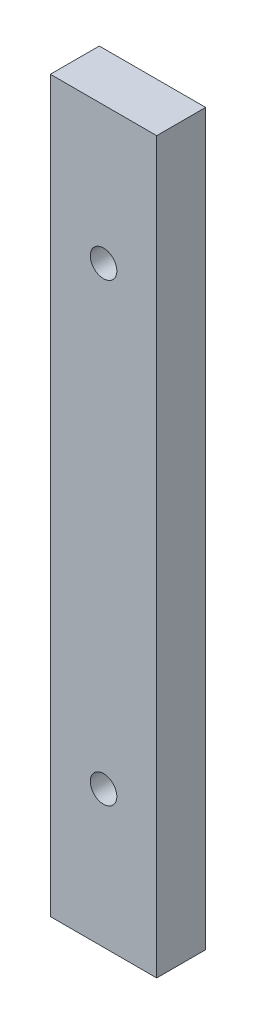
ISO-10303-21;
HEADER;
FILE_DESCRIPTION(('STEP AP214'),'2;1');
FILE_NAME('part.step','',(''),(''),'','','');
FILE_SCHEMA(('AUTOMOTIVE_DESIGN { 1 0 10303 214 1 1 1 1 }'));
ENDSEC;
DATA;
#1=APPLICATION_CONTEXT('core data for automotive mechanical design processes');
#2=APPLICATION_PROTOCOL_DEFINITION('international standard','automotive_design',2000,#1);
#3=PRODUCT_CONTEXT('',#1,'mechanical');
#4=PRODUCT('Part','Part','',(#3));
#5=PRODUCT_RELATED_PRODUCT_CATEGORY('part','',(#4));
#6=PRODUCT_DEFINITION_FORMATION('','',#4);
#7=PRODUCT_DEFINITION_CONTEXT('part definition',#1,'design');
#8=PRODUCT_DEFINITION('design','',#6,#7);
#9=PRODUCT_DEFINITION_SHAPE('','',#8);
#10=(LENGTH_UNIT() NAMED_UNIT(*) SI_UNIT(.MILLI.,.METRE.));
#11=(NAMED_UNIT(*) PLANE_ANGLE_UNIT() SI_UNIT($,.RADIAN.));
#12=(NAMED_UNIT(*) SI_UNIT($,.STERADIAN.) SOLID_ANGLE_UNIT());
#13=UNCERTAINTY_MEASURE_WITH_UNIT(LENGTH_MEASURE(1.E-05),#10,'distance_accuracy_value','');
#14=(GEOMETRIC_REPRESENTATION_CONTEXT(3) GLOBAL_UNCERTAINTY_ASSIGNED_CONTEXT((#13)) GLOBAL_UNIT_ASSIGNED_CONTEXT((#10,
#11,#12)) REPRESENTATION_CONTEXT('',''));
#15=CARTESIAN_POINT('',(0.,0.,0.));
#16=DIRECTION('',(0.,0.,1.));
#17=DIRECTION('',(1.,0.,0.));
#18=AXIS2_PLACEMENT_3D('',#15,#16,#17);
#19=CARTESIAN_POINT('',(0.,0.,4.6));
#20=DIRECTION('',(0.,0.,1.));
#21=DIRECTION('',(1.,0.,0.));
#22=AXIS2_PLACEMENT_3D('',#19,#20,#21);
#23=PLANE('',#22);
#24=CARTESIAN_POINT('',(-17.7963806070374,5.52254901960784,4.6));
#25=DIRECTION('',(0.,0.,1.));
#26=DIRECTION('',(1.,0.,0.));
#27=AXIS2_PLACEMENT_3D('',#24,#25,#26);
#28=CIRCLE('',#27,1.25);
#29=CARTESIAN_POINT('',(-16.5463806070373,5.52254901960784,4.6));
#30=VERTEX_POINT('',#29);
#31=EDGE_CURVE('E123',#30,#30,#28,.T.);
#32=ORIENTED_EDGE('',*,*,#31,.F.);
#33=EDGE_LOOP('',(#32));
#34=FACE_BOUND('',#33,.T.);
#35=CARTESIAN_POINT('',(-17.7963806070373,-37.2774509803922,4.6));
#36=DIRECTION('',(0.,0.,1.));
#37=DIRECTION('',(1.,0.,0.));
#38=AXIS2_PLACEMENT_3D('',#35,#36,#37);
#39=CIRCLE('',#38,1.25);
#40=CARTESIAN_POINT('',(-16.5463806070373,-37.2774509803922,4.6));
#41=VERTEX_POINT('',#40);
#42=EDGE_CURVE('E117',#41,#41,#39,.T.);
#43=ORIENTED_EDGE('',*,*,#42,.F.);
#44=EDGE_LOOP('',(#43));
#45=FACE_BOUND('',#44,.T.);
#46=DIRECTION('',(0.,-1.,0.));
#47=VECTOR('',#46,1.);
#48=CARTESIAN_POINT('',(-22.7963806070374,18.4225490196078,4.6));
#49=LINE('',#48,#47);
#50=CARTESIAN_POINT('',(-22.7963806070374,18.4225490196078,4.6));
#51=VERTEX_POINT('',#50);
#52=CARTESIAN_POINT('',(-22.7963806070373,-50.1774509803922,4.6));
#53=VERTEX_POINT('',#52);
#54=EDGE_CURVE('E89',#51,#53,#49,.T.);
#55=ORIENTED_EDGE('',*,*,#54,.T.);
#56=DIRECTION('',(1.,0.,0.));
#57=VECTOR('',#56,1.);
#58=CARTESIAN_POINT('',(-22.7963806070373,-50.1774509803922,4.6));
#59=LINE('',#58,#57);
#60=CARTESIAN_POINT('',(-12.7963806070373,-50.1774509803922,4.6));
#61=VERTEX_POINT('',#60);
#62=EDGE_CURVE('E85',#53,#61,#59,.T.);
#63=ORIENTED_EDGE('',*,*,#62,.T.);
#64=DIRECTION('',(0.,1.,0.));
#65=VECTOR('',#64,1.);
#66=CARTESIAN_POINT('',(-12.7963806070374,18.4225490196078,4.6));
#67=LINE('',#66,#65);
#68=CARTESIAN_POINT('',(-12.7963806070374,18.4225490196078,4.6));
#69=VERTEX_POINT('',#68);
#70=EDGE_CURVE('E87',#61,#69,#67,.T.);
#71=ORIENTED_EDGE('',*,*,#70,.T.);
#72=DIRECTION('',(-1.,0.,0.));
#73=VECTOR('',#72,1.);
#74=CARTESIAN_POINT('',(-22.7963806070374,18.4225490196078,4.6));
#75=LINE('',#74,#73);
#76=EDGE_CURVE('E55',#69,#51,#75,.T.);
#77=ORIENTED_EDGE('',*,*,#76,.T.);
#78=EDGE_LOOP('',(#55,#63,#71,#77));
#79=FACE_BOUND('',#78,.T.);
#80=ADVANCED_FACE('F38',(#34,#45,#79),#23,.T.);
#81=CARTESIAN_POINT('',(0.,0.,0.));
#82=DIRECTION('',(0.,0.,1.));
#83=DIRECTION('',(1.,0.,0.));
#84=AXIS2_PLACEMENT_3D('',#81,#82,#83);
#85=PLANE('',#84);
#86=CARTESIAN_POINT('',(-17.7963806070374,5.52254901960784,0.));
#87=DIRECTION('',(0.,0.,1.));
#88=DIRECTION('',(1.,0.,0.));
#89=AXIS2_PLACEMENT_3D('',#86,#87,#88);
#90=CIRCLE('',#89,1.25);
#91=CARTESIAN_POINT('',(-16.5463806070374,5.52254901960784,0.));
#92=VERTEX_POINT('',#91);
#93=EDGE_CURVE('E120',#92,#92,#90,.T.);
#94=ORIENTED_EDGE('',*,*,#93,.T.);
#95=EDGE_LOOP('',(#94));
#96=FACE_BOUND('',#95,.T.);
#97=CARTESIAN_POINT('',(-17.7963806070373,-37.2774509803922,0.));
#98=DIRECTION('',(0.,0.,1.));
#99=DIRECTION('',(1.,0.,0.));
#100=AXIS2_PLACEMENT_3D('',#97,#98,#99);
#101=CIRCLE('',#100,1.25);
#102=CARTESIAN_POINT('',(-16.5463806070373,-37.2774509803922,0.));
#103=VERTEX_POINT('',#102);
#104=EDGE_CURVE('E104',#103,#103,#101,.T.);
#105=ORIENTED_EDGE('',*,*,#104,.T.);
#106=EDGE_LOOP('',(#105));
#107=FACE_BOUND('',#106,.T.);
#108=DIRECTION('',(0.,-1.,0.));
#109=VECTOR('',#108,1.);
#110=CARTESIAN_POINT('',(-22.7963806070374,18.4225490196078,0.));
#111=LINE('',#110,#109);
#112=CARTESIAN_POINT('',(-22.7963806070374,18.4225490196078,0.));
#113=VERTEX_POINT('',#112);
#114=CARTESIAN_POINT('',(-22.7963806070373,-50.1774509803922,0.));
#115=VERTEX_POINT('',#114);
#116=EDGE_CURVE('E101',#113,#115,#111,.T.);
#117=ORIENTED_EDGE('',*,*,#116,.F.);
#118=DIRECTION('',(-1.,0.,0.));
#119=VECTOR('',#118,1.);
#120=CARTESIAN_POINT('',(-22.7963806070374,18.4225490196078,0.));
#121=LINE('',#120,#119);
#122=CARTESIAN_POINT('',(-12.7963806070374,18.4225490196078,0.));
#123=VERTEX_POINT('',#122);
#124=EDGE_CURVE('E78',#123,#113,#121,.T.);
#125=ORIENTED_EDGE('',*,*,#124,.F.);
#126=DIRECTION('',(0.,1.,0.));
#127=VECTOR('',#126,1.);
#128=CARTESIAN_POINT('',(-12.7963806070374,18.4225490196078,0.));
#129=LINE('',#128,#127);
#130=CARTESIAN_POINT('',(-12.7963806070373,-50.1774509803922,0.));
#131=VERTEX_POINT('',#130);
#132=EDGE_CURVE('E72',#131,#123,#129,.T.);
#133=ORIENTED_EDGE('',*,*,#132,.F.);
#134=DIRECTION('',(1.,0.,0.));
#135=VECTOR('',#134,1.);
#136=CARTESIAN_POINT('',(-22.7963806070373,-50.1774509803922,0.));
#137=LINE('',#136,#135);
#138=EDGE_CURVE('E93',#115,#131,#137,.T.);
#139=ORIENTED_EDGE('',*,*,#138,.F.);
#140=EDGE_LOOP('',(#117,#125,#133,#139));
#141=FACE_BOUND('',#140,.T.);
#142=ADVANCED_FACE('F112',(#96,#107,#141),#85,.F.);
#143=CARTESIAN_POINT('',(-22.7963806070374,18.4225490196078,4.6));
#144=DIRECTION('',(1.,0.,0.));
#145=DIRECTION('',(0.,1.,0.));
#146=AXIS2_PLACEMENT_3D('',#143,#144,#145);
#147=PLANE('',#146);
#148=ORIENTED_EDGE('',*,*,#116,.T.);
#149=DIRECTION('',(0.,0.,-1.));
#150=VECTOR('',#149,1.);
#151=CARTESIAN_POINT('',(-22.7963806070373,-50.1774509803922,4.6));
#152=LINE('',#151,#150);
#153=EDGE_CURVE('E11',#53,#115,#152,.T.);
#154=ORIENTED_EDGE('',*,*,#153,.F.);
#155=ORIENTED_EDGE('',*,*,#54,.F.);
#156=DIRECTION('',(0.,0.,-1.));
#157=VECTOR('',#156,1.);
#158=CARTESIAN_POINT('',(-22.7963806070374,18.4225490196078,4.6));
#159=LINE('',#158,#157);
#160=EDGE_CURVE('E97',#51,#113,#159,.T.);
#161=ORIENTED_EDGE('',*,*,#160,.T.);
#162=EDGE_LOOP('',(#148,#154,#155,#161));
#163=FACE_BOUND('',#162,.T.);
#164=ADVANCED_FACE('F40',(#163),#147,.F.);
#165=CARTESIAN_POINT('',(-22.7963806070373,-50.1774509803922,4.6));
#166=DIRECTION('',(0.,1.,0.));
#167=DIRECTION('',(0.,0.,1.));
#168=AXIS2_PLACEMENT_3D('',#165,#166,#167);
#169=PLANE('',#168);
#170=ORIENTED_EDGE('',*,*,#138,.T.);
#171=DIRECTION('',(0.,0.,-1.));
#172=VECTOR('',#171,1.);
#173=CARTESIAN_POINT('',(-12.7963806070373,-50.1774509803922,4.6));
#174=LINE('',#173,#172);
#175=EDGE_CURVE('E47',#61,#131,#174,.T.);
#176=ORIENTED_EDGE('',*,*,#175,.F.);
#177=ORIENTED_EDGE('',*,*,#62,.F.);
#178=ORIENTED_EDGE('',*,*,#153,.T.);
#179=EDGE_LOOP('',(#170,#176,#177,#178));
#180=FACE_BOUND('',#179,.T.);
#181=ADVANCED_FACE('F92',(#180),#169,.F.);
#182=CARTESIAN_POINT('',(-12.7963806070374,18.4225490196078,4.6));
#183=DIRECTION('',(-1.,0.,0.));
#184=DIRECTION('',(0.,-1.,0.));
#185=AXIS2_PLACEMENT_3D('',#182,#183,#184);
#186=PLANE('',#185);
#187=ORIENTED_EDGE('',*,*,#132,.T.);
#188=DIRECTION('',(0.,0.,-1.));
#189=VECTOR('',#188,1.);
#190=CARTESIAN_POINT('',(-12.7963806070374,18.4225490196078,4.6));
#191=LINE('',#190,#189);
#192=EDGE_CURVE('E94',#69,#123,#191,.T.);
#193=ORIENTED_EDGE('',*,*,#192,.F.);
#194=ORIENTED_EDGE('',*,*,#70,.F.);
#195=ORIENTED_EDGE('',*,*,#175,.T.);
#196=EDGE_LOOP('',(#187,#193,#194,#195));
#197=FACE_BOUND('',#196,.T.);
#198=ADVANCED_FACE('F95',(#197),#186,.F.);
#199=CARTESIAN_POINT('',(-22.7963806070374,18.4225490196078,4.6));
#200=DIRECTION('',(0.,-1.,0.));
#201=DIRECTION('',(0.,0.,-1.));
#202=AXIS2_PLACEMENT_3D('',#199,#200,#201);
#203=PLANE('',#202);
#204=ORIENTED_EDGE('',*,*,#124,.T.);
#205=ORIENTED_EDGE('',*,*,#160,.F.);
#206=ORIENTED_EDGE('',*,*,#76,.F.);
#207=ORIENTED_EDGE('',*,*,#192,.T.);
#208=EDGE_LOOP('',(#204,#205,#206,#207));
#209=FACE_BOUND('',#208,.T.);
#210=ADVANCED_FACE('F109',(#209),#203,.F.);
#211=CARTESIAN_POINT('',(-17.7963806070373,-37.2774509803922,4.6));
#212=DIRECTION('',(0.,0.,1.));
#213=DIRECTION('',(1.,0.,0.));
#214=AXIS2_PLACEMENT_3D('',#211,#212,#213);
#215=CYLINDRICAL_SURFACE('',#214,1.25);
#216=ORIENTED_EDGE('',*,*,#104,.F.);
#217=EDGE_LOOP('',(#216));
#218=FACE_BOUND('',#217,.T.);
#219=ORIENTED_EDGE('',*,*,#42,.T.);
#220=EDGE_LOOP('',(#219));
#221=FACE_BOUND('',#220,.T.);
#222=ADVANCED_FACE('F134',(#218,#221),#215,.F.);
#223=CARTESIAN_POINT('',(-17.7963806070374,5.52254901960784,4.6));
#224=DIRECTION('',(0.,0.,1.));
#225=DIRECTION('',(1.,0.,0.));
#226=AXIS2_PLACEMENT_3D('',#223,#224,#225);
#227=CYLINDRICAL_SURFACE('',#226,1.25);
#228=ORIENTED_EDGE('',*,*,#93,.F.);
#229=EDGE_LOOP('',(#228));
#230=FACE_BOUND('',#229,.T.);
#231=ORIENTED_EDGE('',*,*,#31,.T.);
#232=EDGE_LOOP('',(#231));
#233=FACE_BOUND('',#232,.T.);
#234=ADVANCED_FACE('F127',(#230,#233),#227,.F.);
#235=CLOSED_SHELL('',(#80,#142,#164,#181,#198,#210,#222,#234));
#236=MANIFOLD_SOLID_BREP('B2',#235);
#237=ADVANCED_BREP_SHAPE_REPRESENTATION('',(#18,#236),#14);
#238=SHAPE_DEFINITION_REPRESENTATION(#9,#237);
ENDSEC;
END-ISO-10303-21;
